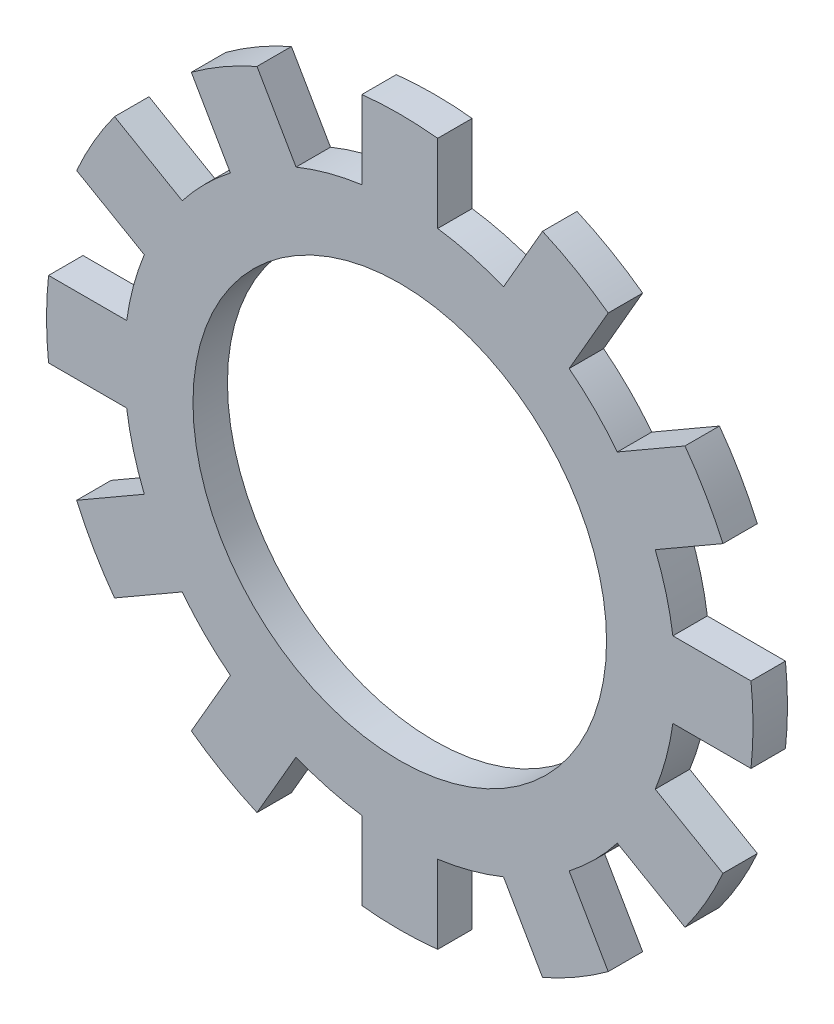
from build123d import *

# Parameters (mm, degrees)
SKETCH1_R                 = 8
SKETCH1_R_2               = 6
BOSS_EXTRUDE1_DEPTH       = 0.5
BOSS_EXTRUDE2_DEPTH       = 0.5
CIRPATTERN2_COUNT         = 12
CIRPATTERN2_COPY_1_DEPTH  = 0.5
CIRPATTERN2_COPY_2_DEPTH  = 0.5
CIRPATTERN2_COPY_3_DEPTH  = 0.5
CIRPATTERN2_COPY_4_DEPTH  = 0.5
CIRPATTERN2_COPY_5_DEPTH  = 0.5
CIRPATTERN2_COPY_6_DEPTH  = 0.5
CIRPATTERN2_COPY_7_DEPTH  = 0.5
CIRPATTERN2_COPY_8_DEPTH  = 0.5
CIRPATTERN2_COPY_9_DEPTH  = 0.5
CIRPATTERN2_COPY_10_DEPTH = 0.5
CIRPATTERN2_COPY_11_DEPTH = 0.5


with BuildPart() as part:
    # Sketch1 → Boss-Extrude1 (new, symmetric)
    with BuildSketch(Plane.XY):
        Circle(SKETCH1_R)
        Circle(SKETCH1_R_2, mode=Mode.SUBTRACT)
    extrude(amount=BOSS_EXTRUDE1_DEPTH, both=True)

    # Sketch3 → Boss-Extrude2 (add, symmetric)
    with BuildSketch(Plane.XY):
        with BuildLine():
            Line((-1.1, 10.190804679), (-1.1, 7.924014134))
            ThreePointArc((-1.1, 7.924014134), (-0.551310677, 7.980980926), (0, 8))
            Line((0, 8), (0, 10.25))
            ThreePointArc((0, 10.25), (-0.550795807, 10.235190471), (-1.1, 10.190804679))
        make_face()
    boss_extrude2 = extrude(amount=BOSS_EXTRUDE2_DEPTH, both=True)

    # Mirror1: Boss-Extrude2 across plane
    add(boss_extrude2.mirror(Plane(origin=(0, 0, 0), x_dir=(0, 0, 1), z_dir=(1, 0, 0))))

    # CirPattern2: Boss-Extrude2 ×12 about axis
    cirpattern2_axis = Axis((0, 0, 0), (0, 0, 1))
    for i in range(1, CIRPATTERN2_COUNT):
        add(boss_extrude2.rotate(cirpattern2_axis, i * 360 / CIRPATTERN2_COUNT))

    # CirPattern2 copy 1 sketch → CirPattern2 copy 1 (add, symmetric)
    with BuildSketch(Plane(origin=(0, 0, 0), x_dir=(-0.8660254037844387, -0.49999999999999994, 0), z_dir=(0, 0, 1))):
        with BuildLine():
            Line((-1.1, -10.190804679), (-1.1, -7.924014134))
            ThreePointArc((-1.1, -7.924014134), (-0.551310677, -7.980980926), (0, -8))
            Line((0, -8), (0, -10.25))
            ThreePointArc((0, -10.25), (-0.550795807, -10.235190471), (-1.1, -10.190804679))
        make_face()
    extrude(amount=CIRPATTERN2_COPY_1_DEPTH, both=True)

    # CirPattern2 copy 2 sketch → CirPattern2 copy 2 (add, symmetric)
    with BuildSketch(Plane(origin=(0, 0, 0), x_dir=(-0.5000000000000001, -0.8660254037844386, 0), z_dir=(0, 0, 1))):
        with BuildLine():
            Line((-1.1, -10.190804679), (-1.1, -7.924014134))
            ThreePointArc((-1.1, -7.924014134), (-0.551310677, -7.980980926), (0, -8))
            Line((0, -8), (0, -10.25))
            ThreePointArc((0, -10.25), (-0.550795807, -10.235190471), (-1.1, -10.190804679))
        make_face()
    extrude(amount=CIRPATTERN2_COPY_2_DEPTH, both=True)

    # CirPattern2 copy 3 sketch → CirPattern2 copy 3 (add, symmetric)
    with BuildSketch(Plane(origin=(0, 0, 0), x_dir=(0, -1, 0), z_dir=(0, 0, 1))):
        with BuildLine():
            Line((-1.1, -10.190804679), (-1.1, -7.924014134))
            ThreePointArc((-1.1, -7.924014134), (-0.551310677, -7.980980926), (0, -8))
            Line((0, -8), (0, -10.25))
            ThreePointArc((0, -10.25), (-0.550795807, -10.235190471), (-1.1, -10.190804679))
        make_face()
    extrude(amount=CIRPATTERN2_COPY_3_DEPTH, both=True)

    # CirPattern2 copy 4 sketch → CirPattern2 copy 4 (add, symmetric)
    with BuildSketch(Plane(origin=(0, 0, 0), x_dir=(0.4999999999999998, -0.8660254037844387, 0), z_dir=(0, 0, 1))):
        with BuildLine():
            Line((-1.1, -10.190804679), (-1.1, -7.924014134))
            ThreePointArc((-1.1, -7.924014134), (-0.551310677, -7.980980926), (0, -8))
            Line((0, -8), (0, -10.25))
            ThreePointArc((0, -10.25), (-0.550795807, -10.235190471), (-1.1, -10.190804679))
        make_face()
    extrude(amount=CIRPATTERN2_COPY_4_DEPTH, both=True)

    # CirPattern2 copy 5 sketch → CirPattern2 copy 5 (add, symmetric)
    with BuildSketch(Plane(origin=(0, 0, 0), x_dir=(0.8660254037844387, -0.49999999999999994, 0), z_dir=(0, 0, 1))):
        with BuildLine():
            Line((-1.1, -10.190804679), (-1.1, -7.924014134))
            ThreePointArc((-1.1, -7.924014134), (-0.551310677, -7.980980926), (0, -8))
            Line((0, -8), (0, -10.25))
            ThreePointArc((0, -10.25), (-0.550795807, -10.235190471), (-1.1, -10.190804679))
        make_face()
    extrude(amount=CIRPATTERN2_COPY_5_DEPTH, both=True)

    # CirPattern2 copy 6 sketch → CirPattern2 copy 6 (add, symmetric)
    with BuildSketch(Plane.XY):
        with BuildLine():
            Line((-1.1, -10.190804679), (-1.1, -7.924014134))
            ThreePointArc((-1.1, -7.924014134), (-0.551310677, -7.980980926), (0, -8))
            Line((0, -8), (0, -10.25))
            ThreePointArc((0, -10.25), (-0.550795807, -10.235190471), (-1.1, -10.190804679))
        make_face()
    extrude(amount=CIRPATTERN2_COPY_6_DEPTH, both=True)

    # CirPattern2 copy 7 sketch → CirPattern2 copy 7 (add, symmetric)
    with BuildSketch(Plane(origin=(0, 0, 0), x_dir=(0.8660254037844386, 0.5000000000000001, 0), z_dir=(0, 0, 1))):
        with BuildLine():
            Line((-1.1, -10.190804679), (-1.1, -7.924014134))
            ThreePointArc((-1.1, -7.924014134), (-0.551310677, -7.980980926), (0, -8))
            Line((0, -8), (0, -10.25))
            ThreePointArc((0, -10.25), (-0.550795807, -10.235190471), (-1.1, -10.190804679))
        make_face()
    extrude(amount=CIRPATTERN2_COPY_7_DEPTH, both=True)

    # CirPattern2 copy 8 sketch → CirPattern2 copy 8 (add, symmetric)
    with BuildSketch(Plane(origin=(0, 0, 0), x_dir=(0.5000000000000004, 0.8660254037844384, 0), z_dir=(0, 0, 1))):
        with BuildLine():
            Line((-1.1, -10.190804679), (-1.1, -7.924014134))
            ThreePointArc((-1.1, -7.924014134), (-0.551310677, -7.980980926), (0, -8))
            Line((0, -8), (0, -10.25))
            ThreePointArc((0, -10.25), (-0.550795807, -10.235190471), (-1.1, -10.190804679))
        make_face()
    extrude(amount=CIRPATTERN2_COPY_8_DEPTH, both=True)

    # CirPattern2 copy 9 sketch → CirPattern2 copy 9 (add, symmetric)
    with BuildSketch(Plane(origin=(0, 0, 0), x_dir=(0, 1, 0), z_dir=(0, 0, 1))):
        with BuildLine():
            Line((-1.1, -10.190804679), (-1.1, -7.924014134))
            ThreePointArc((-1.1, -7.924014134), (-0.551310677, -7.980980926), (0, -8))
            Line((0, -8), (0, -10.25))
            ThreePointArc((0, -10.25), (-0.550795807, -10.235190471), (-1.1, -10.190804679))
        make_face()
    extrude(amount=CIRPATTERN2_COPY_9_DEPTH, both=True)

    # CirPattern2 copy 10 sketch → CirPattern2 copy 10 (add, symmetric)
    with BuildSketch(Plane(origin=(0, 0, 0), x_dir=(-0.5000000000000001, 0.8660254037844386, 0), z_dir=(0, 0, 1))):
        with BuildLine():
            Line((-1.1, -10.190804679), (-1.1, -7.924014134))
            ThreePointArc((-1.1, -7.924014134), (-0.551310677, -7.980980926), (0, -8))
            Line((0, -8), (0, -10.25))
            ThreePointArc((0, -10.25), (-0.550795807, -10.235190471), (-1.1, -10.190804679))
        make_face()
    extrude(amount=CIRPATTERN2_COPY_10_DEPTH, both=True)

    # CirPattern2 copy 11 sketch → CirPattern2 copy 11 (add, symmetric)
    with BuildSketch(Plane(origin=(0, 0, 0), x_dir=(-0.8660254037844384, 0.5000000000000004, 0), z_dir=(0, 0, 1))):
        with BuildLine():
            Line((-1.1, -10.190804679), (-1.1, -7.924014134))
            ThreePointArc((-1.1, -7.924014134), (-0.551310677, -7.980980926), (0, -8))
            Line((0, -8), (0, -10.25))
            ThreePointArc((0, -10.25), (-0.550795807, -10.235190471), (-1.1, -10.190804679))
        make_face()
    extrude(amount=CIRPATTERN2_COPY_11_DEPTH, both=True)


solid = part.part
